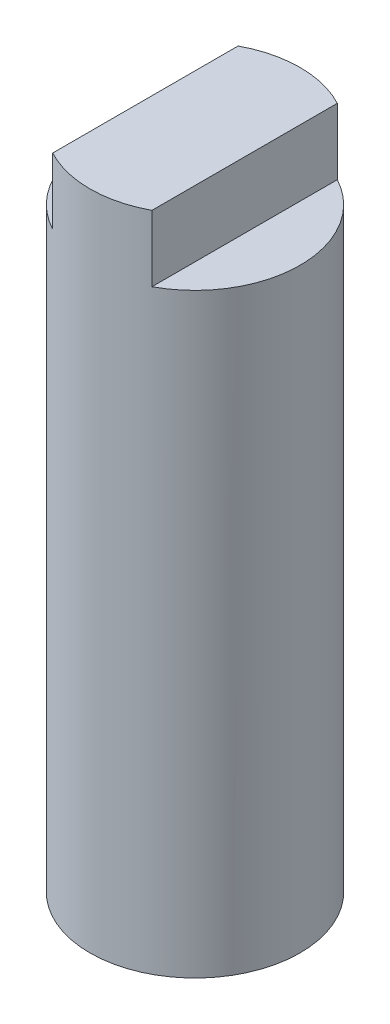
ISO-10303-21;
HEADER;
FILE_DESCRIPTION(('STEP AP214'),'2;1');
FILE_NAME('part.step','',(''),(''),'','','');
FILE_SCHEMA(('AUTOMOTIVE_DESIGN { 1 0 10303 214 1 1 1 1 }'));
ENDSEC;
DATA;
#1=APPLICATION_CONTEXT('core data for automotive mechanical design processes');
#2=APPLICATION_PROTOCOL_DEFINITION('international standard','automotive_design',2000,#1);
#3=PRODUCT_CONTEXT('',#1,'mechanical');
#4=PRODUCT('Part','Part','',(#3));
#5=PRODUCT_RELATED_PRODUCT_CATEGORY('part','',(#4));
#6=PRODUCT_DEFINITION_FORMATION('','',#4);
#7=PRODUCT_DEFINITION_CONTEXT('part definition',#1,'design');
#8=PRODUCT_DEFINITION('design','',#6,#7);
#9=PRODUCT_DEFINITION_SHAPE('','',#8);
#10=(LENGTH_UNIT() NAMED_UNIT(*) SI_UNIT(.MILLI.,.METRE.));
#11=(NAMED_UNIT(*) PLANE_ANGLE_UNIT() SI_UNIT($,.RADIAN.));
#12=(NAMED_UNIT(*) SI_UNIT($,.STERADIAN.) SOLID_ANGLE_UNIT());
#13=UNCERTAINTY_MEASURE_WITH_UNIT(LENGTH_MEASURE(1.E-05),#10,'distance_accuracy_value','');
#14=(GEOMETRIC_REPRESENTATION_CONTEXT(3) GLOBAL_UNCERTAINTY_ASSIGNED_CONTEXT((#13)) GLOBAL_UNIT_ASSIGNED_CONTEXT((#10,
#11,#12)) REPRESENTATION_CONTEXT('',''));
#15=CARTESIAN_POINT('',(0.,0.,0.));
#16=DIRECTION('',(0.,0.,1.));
#17=DIRECTION('',(1.,0.,0.));
#18=AXIS2_PLACEMENT_3D('',#15,#16,#17);
#19=CARTESIAN_POINT('',(0.,10.,0.));
#20=DIRECTION('',(0.,-1.,0.));
#21=DIRECTION('',(0.,0.,-1.));
#22=AXIS2_PLACEMENT_3D('',#19,#20,#21);
#23=CYLINDRICAL_SURFACE('',#22,3.1775);
#24=CARTESIAN_POINT('',(0.,-10.,0.));
#25=DIRECTION('',(0.,1.,0.));
#26=DIRECTION('',(0.,0.,1.));
#27=AXIS2_PLACEMENT_3D('',#24,#25,#26);
#28=CIRCLE('',#27,3.1775);
#29=CARTESIAN_POINT('',(0.,-10.,3.1775));
#30=VERTEX_POINT('',#29);
#31=EDGE_CURVE('E90',#30,#30,#28,.T.);
#32=ORIENTED_EDGE('',*,*,#31,.T.);
#33=EDGE_LOOP('',(#32));
#34=FACE_BOUND('',#33,.T.);
#35=DIRECTION('',(0.,-1.,0.));
#36=VECTOR('',#35,1.);
#37=CARTESIAN_POINT('',(-1.5,10.,-2.80116158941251));
#38=LINE('',#37,#36);
#39=CARTESIAN_POINT('',(-1.5,10.,-2.80116158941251));
#40=VERTEX_POINT('',#39);
#41=CARTESIAN_POINT('',(-1.5,8.,-2.80116158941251));
#42=VERTEX_POINT('',#41);
#43=EDGE_CURVE('E93',#40,#42,#38,.T.);
#44=ORIENTED_EDGE('',*,*,#43,.F.);
#45=CARTESIAN_POINT('',(0.,10.,0.));
#46=DIRECTION('',(0.,1.,0.));
#47=DIRECTION('',(0.,0.,1.));
#48=AXIS2_PLACEMENT_3D('',#45,#46,#47);
#49=CIRCLE('',#48,3.1775);
#50=CARTESIAN_POINT('',(1.5,10.,-2.80116158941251));
#51=VERTEX_POINT('',#50);
#52=EDGE_CURVE('E81',#51,#40,#49,.T.);
#53=ORIENTED_EDGE('',*,*,#52,.F.);
#54=DIRECTION('',(0.,-1.,0.));
#55=VECTOR('',#54,1.);
#56=CARTESIAN_POINT('',(1.5,10.,-2.80116158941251));
#57=LINE('',#56,#55);
#58=CARTESIAN_POINT('',(1.5,8.,-2.80116158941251));
#59=VERTEX_POINT('',#58);
#60=EDGE_CURVE('E55',#59,#51,#57,.F.);
#61=ORIENTED_EDGE('',*,*,#60,.F.);
#62=CARTESIAN_POINT('',(0.,8.,0.));
#63=DIRECTION('',(0.,1.,0.));
#64=DIRECTION('',(0.,0.,1.));
#65=AXIS2_PLACEMENT_3D('',#62,#63,#64);
#66=CIRCLE('',#65,3.1775);
#67=CARTESIAN_POINT('',(1.5,8.,2.80116158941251));
#68=VERTEX_POINT('',#67);
#69=EDGE_CURVE('E36',#68,#59,#66,.T.);
#70=ORIENTED_EDGE('',*,*,#69,.F.);
#71=DIRECTION('',(0.,-1.,0.));
#72=VECTOR('',#71,1.);
#73=CARTESIAN_POINT('',(1.5,10.,2.80116158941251));
#74=LINE('',#73,#72);
#75=CARTESIAN_POINT('',(1.5,10.,2.80116158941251));
#76=VERTEX_POINT('',#75);
#77=EDGE_CURVE('E74',#76,#68,#74,.T.);
#78=ORIENTED_EDGE('',*,*,#77,.F.);
#79=CARTESIAN_POINT('',(-1.5,10.,2.80116158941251));
#80=VERTEX_POINT('',#79);
#81=EDGE_CURVE('E87',#80,#76,#49,.T.);
#82=ORIENTED_EDGE('',*,*,#81,.F.);
#83=DIRECTION('',(0.,-1.,0.));
#84=VECTOR('',#83,1.);
#85=CARTESIAN_POINT('',(-1.5,10.,2.80116158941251));
#86=LINE('',#85,#84);
#87=CARTESIAN_POINT('',(-1.5,8.,2.80116158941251));
#88=VERTEX_POINT('',#87);
#89=EDGE_CURVE('E47',#88,#80,#86,.F.);
#90=ORIENTED_EDGE('',*,*,#89,.F.);
#91=EDGE_CURVE('E12',#42,#88,#66,.T.);
#92=ORIENTED_EDGE('',*,*,#91,.F.);
#93=EDGE_LOOP('',(#44,#53,#61,#70,#78,#82,#90,#92));
#94=FACE_BOUND('',#93,.T.);
#95=ADVANCED_FACE('F33',(#34,#94),#23,.T.);
#96=CARTESIAN_POINT('',(0.,10.,0.));
#97=DIRECTION('',(0.,1.,0.));
#98=DIRECTION('',(0.,0.,1.));
#99=AXIS2_PLACEMENT_3D('',#96,#97,#98);
#100=PLANE('',#99);
#101=ORIENTED_EDGE('',*,*,#52,.T.);
#102=DIRECTION('',(0.,0.,1.));
#103=VECTOR('',#102,1.);
#104=CARTESIAN_POINT('',(-1.5,10.,0.));
#105=LINE('',#104,#103);
#106=EDGE_CURVE('E80',#40,#80,#105,.T.);
#107=ORIENTED_EDGE('',*,*,#106,.T.);
#108=ORIENTED_EDGE('',*,*,#81,.T.);
#109=DIRECTION('',(0.,0.,-1.));
#110=VECTOR('',#109,1.);
#111=CARTESIAN_POINT('',(1.5,10.,0.));
#112=LINE('',#111,#110);
#113=EDGE_CURVE('E71',#76,#51,#112,.T.);
#114=ORIENTED_EDGE('',*,*,#113,.T.);
#115=EDGE_LOOP('',(#101,#107,#108,#114));
#116=FACE_BOUND('',#115,.T.);
#117=ADVANCED_FACE('F89',(#116),#100,.T.);
#118=CARTESIAN_POINT('',(0.,-10.,0.));
#119=DIRECTION('',(0.,1.,0.));
#120=DIRECTION('',(0.,0.,1.));
#121=AXIS2_PLACEMENT_3D('',#118,#119,#120);
#122=PLANE('',#121);
#123=ORIENTED_EDGE('',*,*,#31,.F.);
#124=EDGE_LOOP('',(#123));
#125=FACE_BOUND('',#124,.T.);
#126=ADVANCED_FACE('F122',(#125),#122,.F.);
#127=CARTESIAN_POINT('',(1.5,8.,3.44254211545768));
#128=DIRECTION('',(1.,0.,0.));
#129=DIRECTION('',(0.,0.,-1.));
#130=AXIS2_PLACEMENT_3D('',#127,#128,#129);
#131=PLANE('',#130);
#132=ORIENTED_EDGE('',*,*,#77,.T.);
#133=DIRECTION('',(0.,0.,-1.));
#134=VECTOR('',#133,1.);
#135=CARTESIAN_POINT('',(1.5,8.,3.44254211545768));
#136=LINE('',#135,#134);
#137=EDGE_CURVE('E99',#68,#59,#136,.T.);
#138=ORIENTED_EDGE('',*,*,#137,.T.);
#139=ORIENTED_EDGE('',*,*,#60,.T.);
#140=ORIENTED_EDGE('',*,*,#113,.F.);
#141=EDGE_LOOP('',(#132,#138,#139,#140));
#142=FACE_BOUND('',#141,.T.);
#143=ADVANCED_FACE('F73',(#142),#131,.T.);
#144=CARTESIAN_POINT('',(0.,8.,0.));
#145=DIRECTION('',(0.,1.,0.));
#146=DIRECTION('',(0.,0.,1.));
#147=AXIS2_PLACEMENT_3D('',#144,#145,#146);
#148=PLANE('',#147);
#149=ORIENTED_EDGE('',*,*,#69,.T.);
#150=ORIENTED_EDGE('',*,*,#137,.F.);
#151=EDGE_LOOP('',(#149,#150));
#152=FACE_BOUND('',#151,.T.);
#153=ADVANCED_FACE('F98',(#152),#148,.T.);
#154=ORIENTED_EDGE('',*,*,#91,.T.);
#155=DIRECTION('',(0.,0.,1.));
#156=VECTOR('',#155,1.);
#157=CARTESIAN_POINT('',(-1.5,8.,3.44254211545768));
#158=LINE('',#157,#156);
#159=EDGE_CURVE('E100',#42,#88,#158,.T.);
#160=ORIENTED_EDGE('',*,*,#159,.F.);
#161=EDGE_LOOP('',(#154,#160));
#162=FACE_BOUND('',#161,.T.);
#163=ADVANCED_FACE('F108',(#162),#148,.T.);
#164=CARTESIAN_POINT('',(-1.5,8.,3.44254211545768));
#165=DIRECTION('',(-1.,0.,0.));
#166=DIRECTION('',(0.,0.,1.));
#167=AXIS2_PLACEMENT_3D('',#164,#165,#166);
#168=PLANE('',#167);
#169=ORIENTED_EDGE('',*,*,#43,.T.);
#170=ORIENTED_EDGE('',*,*,#159,.T.);
#171=ORIENTED_EDGE('',*,*,#89,.T.);
#172=ORIENTED_EDGE('',*,*,#106,.F.);
#173=EDGE_LOOP('',(#169,#170,#171,#172));
#174=FACE_BOUND('',#173,.T.);
#175=ADVANCED_FACE('F105',(#174),#168,.T.);
#176=CLOSED_SHELL('',(#95,#117,#126,#143,#153,#163,#175));
#177=MANIFOLD_SOLID_BREP('B2',#176);
#178=ADVANCED_BREP_SHAPE_REPRESENTATION('',(#18,#177),#14);
#179=SHAPE_DEFINITION_REPRESENTATION(#9,#178);
ENDSEC;
END-ISO-10303-21;
